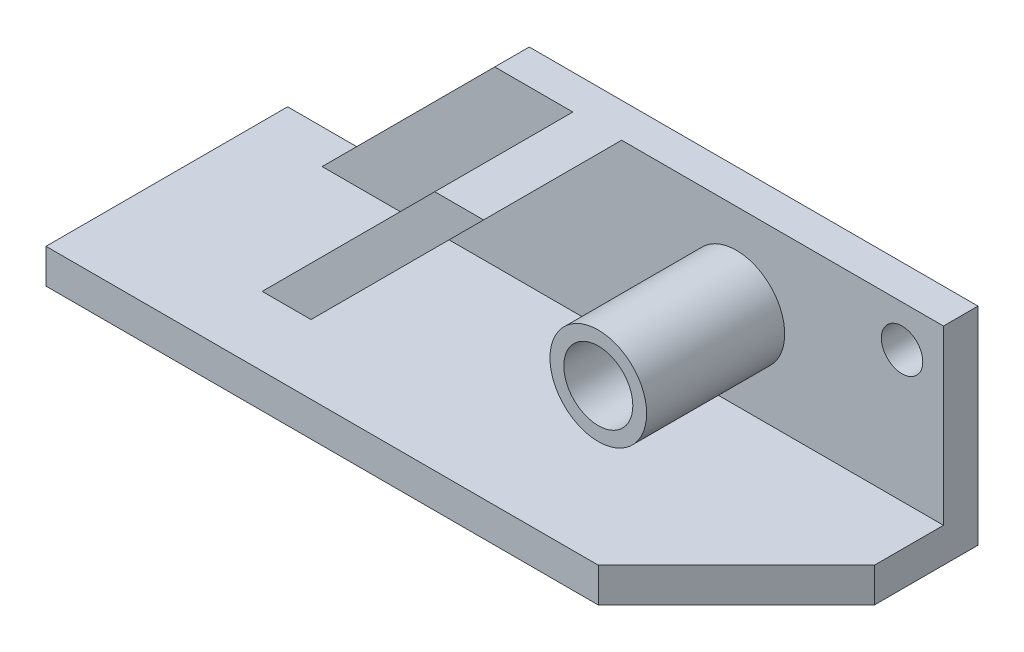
from build123d import *

# Parameters (mm, degrees)
EXTRUDE1_DEPTH = 5
SKETCH2_R      = 3
EXTRUDE2_DEPTH = 5
SKETCH3_R      = 7
SKETCH3_R_2    = 5
EXTRUDE3_DEPTH = 20


with BuildPart() as part:
    # Sketch1 → Extrude1 (new body)
    with BuildSketch(Plane(origin=(0, 0, 0), x_dir=(1, 0, 0), z_dir=(0, 1, 0))):
        Polygon((0, 0), (100, 0), (100, -15), (80, -35), (0, -35), align=None)
    extrude(amount=EXTRUDE1_DEPTH)

    # Sketch2 → Extrude2 (add)
    with BuildSketch(Plane.XY):
        Polygon((10, 5), (100, 5), (100, 30), (35, 30), align=None)
        with Locations((94, 24)):
            Circle(SKETCH2_R, mode=Mode.SUBTRACT)
    extrude(amount=EXTRUDE2_DEPTH)

    # Sketch3 → Extrude3 (add)
    # profile 1 of 2: a face of its own
    with BuildSketch(Plane.XY.offset(5)):
        with Locations(Location((70, 17.5, 0), (0, 0, 180))):
            Circle(SKETCH3_R)
        with Locations((70, 17.5)):
            Circle(SKETCH3_R_2, mode=Mode.SUBTRACT)
    # profile 2 of 2: a face of its own
    with BuildSketch(Plane.XY.offset(5)):
        Polygon((46.313708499, 30), (21.313708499, 5), (28.384776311, 5), (53.384776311, 30), align=None)
    extrude(amount=EXTRUDE3_DEPTH)


solid = part.part
